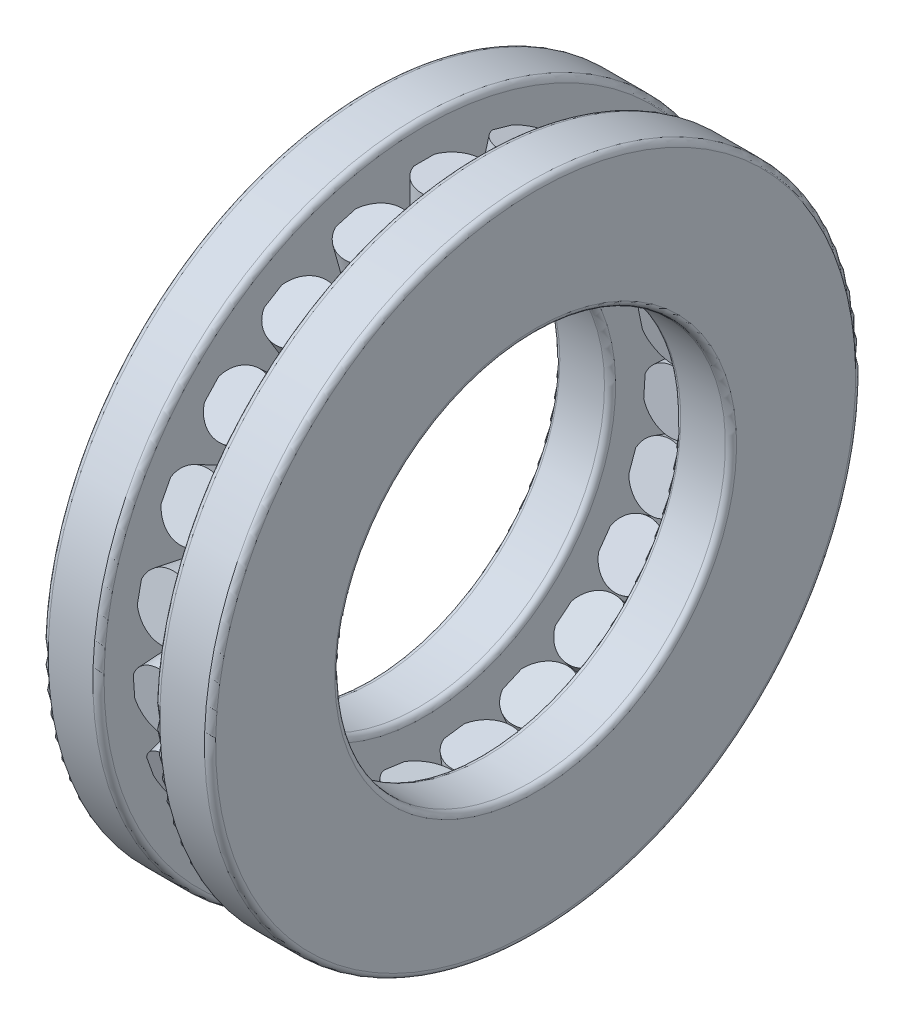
from build123d import *

# Parameters (mm, degrees)
SKETCH1_W               = 7.5
SKETCH1_H               = 3
SKETCH2_W               = 3.75
SKETCH2_H               = 1.6
SKETCH3_W               = 7
SKETCH3_H               = 3
CIRCULAR_PATTERN1_COUNT = 23
FILLET1_R               = 0.3


with BuildPart() as part:
    # Sketch1 → Revolve1 (revolve)
    with BuildSketch(Plane(origin=(-7.03002736, 10.46997264, 0), x_dir=(0, 1, 0), z_dir=(0, 0, 1))):
        with Locations((-24.21997264, -5.53002736)):
            Rectangle(SKETCH1_W, SKETCH1_H)
    revolve(axis=Axis((-25.185294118, 0, 0), (1, 0, 0)))

    # Sketch2 → Revolve2 (revolve)
    with BuildSketch(Plane(origin=(1.570880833, -3.029119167, 0), x_dir=(0, -1, 0), z_dir=(0, 0, 1))):
        with Locations((-16.779119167, 0.729119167)):
            Rectangle(SKETCH2_W, SKETCH2_H)
    revolve2 = revolve(axis=Axis((1.5, 16.546140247, 0), (0, -1, 0)))

    # Sketch3 → Revolve3 (revolve)
    with BuildSketch(Plane(origin=(-8.782998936, 8.717001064, 0), x_dir=(0, 1, 0), z_dir=(0, 0, 1))):
        with Locations((-22.717001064, -13.282998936)):
            Rectangle(SKETCH3_W, SKETCH3_H)
    revolve(axis=Axis((-15.612745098, 0, 0), (1, 0, 0)))

    # Circular-Pattern1: Revolve2 ×23 about axis
    circular_pattern1_axis = Axis((0, 0, 0), (1, 0, 0))
    for i in range(1, CIRCULAR_PATTERN1_COUNT):
        add(revolve2.rotate(circular_pattern1_axis, i * 360 / CIRCULAR_PATTERN1_COUNT))

    # Fillet1
    fillet1_edges = [part.edges().sort_by_distance(p)[0] for p in [
        (3, 17.5, 0),
        (6, 17.5, 0),
        (6, 10.5, 0),
        (3, 10.5, 0),
        (0, 17.5, 0),
        (0, 10, 0),
        (-3, 10, 0),
        (-3, 17.5, 0),
    ]]
    fillet(fillet1_edges, radius=FILLET1_R)


solid = part.part
